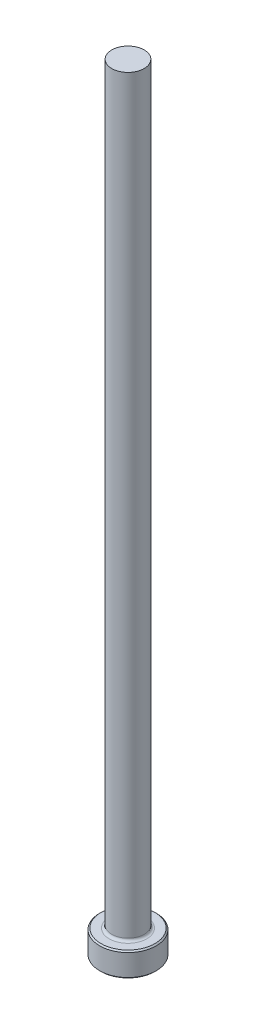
from build123d import *

# Parameters (mm, degrees)
CHAMFER1_SIZE = 0.254
FILLET1_R     = 0.508


with BuildPart() as part:
    # Sketch1 → Revolve1 (revolve)
    with BuildSketch(Plane.XY, mode=Mode.PRIVATE) as revolve1_sk:
        Polygon((0, 0), (-5.5499, 0), (-5.5499, 4.7498), (-3.175, 4.7498), (-3.175, 152.4), (0, 152.4), align=None)
    revolve(revolve1_sk.sketch.rotate(Axis((0, 259.958771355, 0), (0, -1, 0)), 270), axis=Axis((0, 259.958771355, 0), (0, -1, 0)))

    # Chamfer1
    chamfer1_edges = [part.edges().sort_by_distance(p)[0] for p in [
        (0, 4.7498, -5.5499),
        (0, 0, -5.5499),
    ]]
    chamfer(chamfer1_edges, length=CHAMFER1_SIZE)

    # Fillet1
    fillet1_edges = [part.edges().sort_by_distance(p)[0] for p in [
        (0, 4.7498, -3.175),
    ]]
    fillet(fillet1_edges, radius=FILLET1_R)


solid = part.part
